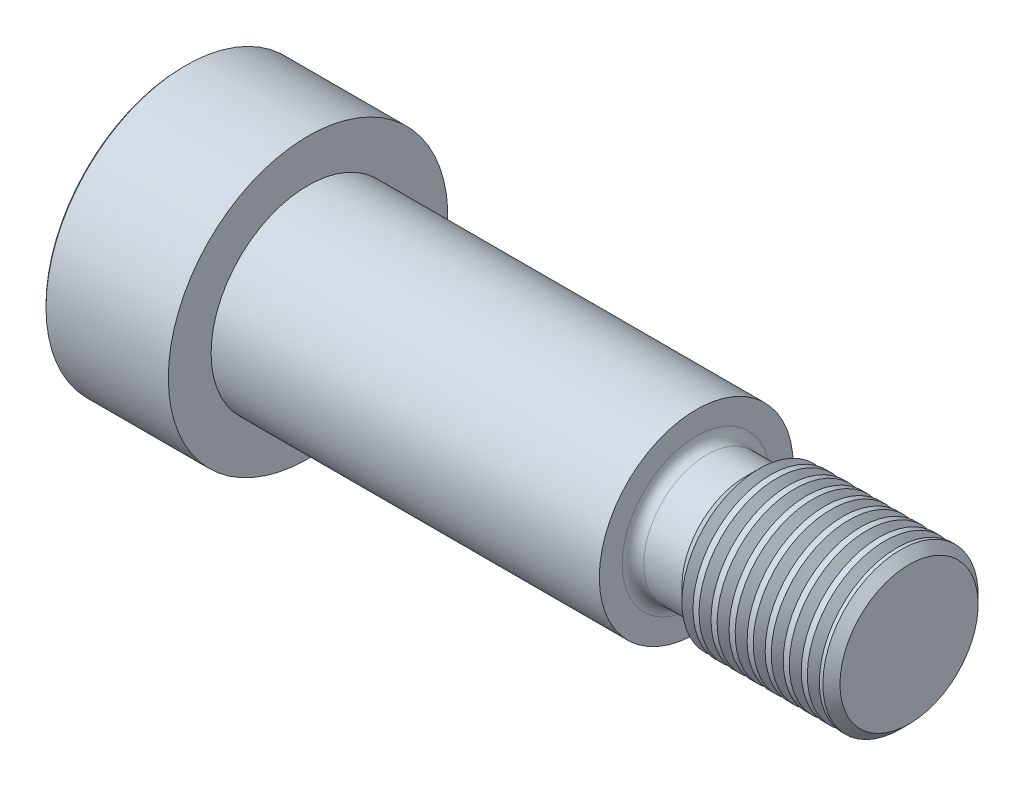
ISO-10303-21;
HEADER;
FILE_DESCRIPTION(('STEP AP214'),'2;1');
FILE_NAME('part.step','',(''),(''),'','','');
FILE_SCHEMA(('AUTOMOTIVE_DESIGN { 1 0 10303 214 1 1 1 1 }'));
ENDSEC;
DATA;
#1=APPLICATION_CONTEXT('core data for automotive mechanical design processes');
#2=APPLICATION_PROTOCOL_DEFINITION('international standard','automotive_design',2000,#1);
#3=PRODUCT_CONTEXT('',#1,'mechanical');
#4=PRODUCT('Part','Part','',(#3));
#5=PRODUCT_RELATED_PRODUCT_CATEGORY('part','',(#4));
#6=PRODUCT_DEFINITION_FORMATION('','',#4);
#7=PRODUCT_DEFINITION_CONTEXT('part definition',#1,'design');
#8=PRODUCT_DEFINITION('design','',#6,#7);
#9=PRODUCT_DEFINITION_SHAPE('','',#8);
#10=(LENGTH_UNIT() NAMED_UNIT(*) SI_UNIT(.MILLI.,.METRE.));
#11=(NAMED_UNIT(*) PLANE_ANGLE_UNIT() SI_UNIT($,.RADIAN.));
#12=(NAMED_UNIT(*) SI_UNIT($,.STERADIAN.) SOLID_ANGLE_UNIT());
#13=UNCERTAINTY_MEASURE_WITH_UNIT(LENGTH_MEASURE(1.E-05),#10,'distance_accuracy_value','');
#14=(GEOMETRIC_REPRESENTATION_CONTEXT(3) GLOBAL_UNCERTAINTY_ASSIGNED_CONTEXT((#13)) GLOBAL_UNIT_ASSIGNED_CONTEXT((#10,
#11,#12)) REPRESENTATION_CONTEXT('',''));
#15=CARTESIAN_POINT('',(0.,0.,0.));
#16=DIRECTION('',(0.,0.,1.));
#17=DIRECTION('',(1.,0.,0.));
#18=AXIS2_PLACEMENT_3D('',#15,#16,#17);
#19=CARTESIAN_POINT('',(0.,0.,0.));
#20=DIRECTION('',(-1.,0.,0.));
#21=DIRECTION('',(0.,0.,1.));
#22=AXIS2_PLACEMENT_3D('',#19,#20,#21);
#23=PLANE('',#22);
#24=CARTESIAN_POINT('',(0.,0.,0.));
#25=DIRECTION('',(-1.,0.,0.));
#26=DIRECTION('',(0.,0.,1.));
#27=AXIS2_PLACEMENT_3D('',#24,#25,#26);
#28=CIRCLE('',#27,17.75);
#29=CARTESIAN_POINT('',(0.,0.,17.75));
#30=VERTEX_POINT('',#29);
#31=EDGE_CURVE('E43',#30,#30,#28,.T.);
#32=ORIENTED_EDGE('',*,*,#31,.T.);
#33=EDGE_LOOP('',(#32));
#34=FACE_BOUND('',#33,.T.);
#35=DIRECTION('',(0.,-0.500000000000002,-0.866025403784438));
#36=VECTOR('',#35,1.);
#37=CARTESIAN_POINT('',(0.,-3.46410161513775,6.));
#38=LINE('',#37,#36);
#39=CARTESIAN_POINT('',(0.,-3.46410161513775,6.));
#40=VERTEX_POINT('',#39);
#41=CARTESIAN_POINT('',(0.,-6.92820323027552,0.));
#42=VERTEX_POINT('',#41);
#43=EDGE_CURVE('E51',#40,#42,#38,.T.);
#44=ORIENTED_EDGE('',*,*,#43,.T.);
#45=DIRECTION('',(0.,0.500000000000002,-0.866025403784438));
#46=VECTOR('',#45,1.);
#47=CARTESIAN_POINT('',(0.,-6.92820323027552,0.));
#48=LINE('',#47,#46);
#49=CARTESIAN_POINT('',(0.,-3.46410161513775,-6.));
#50=VERTEX_POINT('',#49);
#51=EDGE_CURVE('E183',#42,#50,#48,.T.);
#52=ORIENTED_EDGE('',*,*,#51,.T.);
#53=DIRECTION('',(0.,1.,0.));
#54=VECTOR('',#53,1.);
#55=CARTESIAN_POINT('',(0.,-3.46410161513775,-6.));
#56=LINE('',#55,#54);
#57=CARTESIAN_POINT('',(0.,3.46410161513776,-6.));
#58=VERTEX_POINT('',#57);
#59=EDGE_CURVE('E136',#50,#58,#56,.T.);
#60=ORIENTED_EDGE('',*,*,#59,.T.);
#61=DIRECTION('',(0.,0.5,0.866025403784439));
#62=VECTOR('',#61,1.);
#63=CARTESIAN_POINT('',(0.,3.46410161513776,-6.));
#64=LINE('',#63,#62);
#65=CARTESIAN_POINT('',(0.,6.92820323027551,0.));
#66=VERTEX_POINT('',#65);
#67=EDGE_CURVE('E266',#58,#66,#64,.T.);
#68=ORIENTED_EDGE('',*,*,#67,.T.);
#69=DIRECTION('',(0.,-0.5,0.866025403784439));
#70=VECTOR('',#69,1.);
#71=CARTESIAN_POINT('',(0.,6.92820323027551,0.));
#72=LINE('',#71,#70);
#73=CARTESIAN_POINT('',(0.,3.46410161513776,6.));
#74=VERTEX_POINT('',#73);
#75=EDGE_CURVE('E268',#66,#74,#72,.T.);
#76=ORIENTED_EDGE('',*,*,#75,.T.);
#77=DIRECTION('',(0.,-1.,0.));
#78=VECTOR('',#77,1.);
#79=CARTESIAN_POINT('',(0.,3.46410161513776,6.));
#80=LINE('',#79,#78);
#81=EDGE_CURVE('E270',#74,#40,#80,.T.);
#82=ORIENTED_EDGE('',*,*,#81,.T.);
#83=EDGE_LOOP('',(#44,#52,#60,#68,#76,#82));
#84=FACE_BOUND('',#83,.T.);
#85=ADVANCED_FACE('F34',(#34,#84),#23,.T.);
#86=CARTESIAN_POINT('',(72.3,0.,0.));
#87=DIRECTION('',(1.,0.,0.));
#88=DIRECTION('',(0.,0.,-1.));
#89=AXIS2_PLACEMENT_3D('',#86,#87,#88);
#90=CONICAL_SURFACE('',#89,8.15,0.785398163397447);
#91=CARTESIAN_POINT('',(74.0786683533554,0.,0.));
#92=DIRECTION('',(-1.,0.,0.));
#93=DIRECTION('',(0.,-1.,0.));
#94=AXIS2_PLACEMENT_3D('',#91,#92,#93);
#95=CIRCLE('',#94,9.92866835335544);
#96=CARTESIAN_POINT('',(74.0786683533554,-9.92866835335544,0.));
#97=VERTEX_POINT('',#96);
#98=EDGE_CURVE('E176',#97,#97,#95,.F.);
#99=ORIENTED_EDGE('',*,*,#98,.F.);
#100=EDGE_LOOP('',(#99));
#101=FACE_BOUND('',#100,.T.);
#102=CARTESIAN_POINT('',(72.3,0.,0.));
#103=DIRECTION('',(-1.,0.,0.));
#104=DIRECTION('',(0.,0.,1.));
#105=AXIS2_PLACEMENT_3D('',#102,#103,#104);
#106=CIRCLE('',#105,8.15);
#107=CARTESIAN_POINT('',(72.3,0.,8.15));
#108=VERTEX_POINT('',#107);
#109=EDGE_CURVE('E165',#108,#108,#106,.T.);
#110=ORIENTED_EDGE('',*,*,#109,.F.);
#111=EDGE_LOOP('',(#110));
#112=FACE_BOUND('',#111,.T.);
#113=ADVANCED_FACE('F323',(#101,#112),#90,.T.);
#114=CARTESIAN_POINT('',(-6.34999999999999,0.,0.));
#115=DIRECTION('',(-1.,0.,0.));
#116=DIRECTION('',(0.,0.,1.));
#117=AXIS2_PLACEMENT_3D('',#114,#115,#116);
#118=CYLINDRICAL_SURFACE('',#117,8.15);
#119=ORIENTED_EDGE('',*,*,#109,.T.);
#120=EDGE_LOOP('',(#119));
#121=FACE_BOUND('',#120,.T.);
#122=CARTESIAN_POINT('',(67.38,0.,0.));
#123=DIRECTION('',(-1.,0.,0.));
#124=DIRECTION('',(0.,0.,1.));
#125=AXIS2_PLACEMENT_3D('',#122,#123,#124);
#126=CIRCLE('',#125,8.15);
#127=CARTESIAN_POINT('',(67.38,0.,8.15));
#128=VERTEX_POINT('',#127);
#129=EDGE_CURVE('E162',#128,#128,#126,.T.);
#130=ORIENTED_EDGE('',*,*,#129,.F.);
#131=EDGE_LOOP('',(#130));
#132=FACE_BOUND('',#131,.T.);
#133=ADVANCED_FACE('F329',(#121,#132),#118,.T.);
#134=CARTESIAN_POINT('',(67.38,0.,0.));
#135=DIRECTION('',(-1.,0.,0.));
#136=DIRECTION('',(0.,0.,1.));
#137=AXIS2_PLACEMENT_3D('',#134,#135,#136);
#138=TOROIDAL_SURFACE('',#137,9.53,1.38);
#139=ORIENTED_EDGE('',*,*,#129,.T.);
#140=EDGE_LOOP('',(#139));
#141=FACE_BOUND('',#140,.T.);
#142=CARTESIAN_POINT('',(66.,0.,0.));
#143=DIRECTION('',(-1.,0.,0.));
#144=DIRECTION('',(0.,0.,1.));
#145=AXIS2_PLACEMENT_3D('',#142,#143,#144);
#146=CIRCLE('',#145,9.53);
#147=CARTESIAN_POINT('',(66.,0.,9.53));
#148=VERTEX_POINT('',#147);
#149=EDGE_CURVE('E159',#148,#148,#146,.T.);
#150=ORIENTED_EDGE('',*,*,#149,.F.);
#151=EDGE_LOOP('',(#150));
#152=FACE_BOUND('',#151,.T.);
#153=ADVANCED_FACE('F350',(#141,#152),#138,.F.);
#154=CARTESIAN_POINT('',(66.,12.49,0.));
#155=DIRECTION('',(1.,0.,0.));
#156=DIRECTION('',(0.,0.,-1.));
#157=AXIS2_PLACEMENT_3D('',#154,#155,#156);
#158=PLANE('',#157);
#159=ORIENTED_EDGE('',*,*,#149,.T.);
#160=EDGE_LOOP('',(#159));
#161=FACE_BOUND('',#160,.T.);
#162=CARTESIAN_POINT('',(66.,0.,0.));
#163=DIRECTION('',(-1.,0.,0.));
#164=DIRECTION('',(0.,0.,1.));
#165=AXIS2_PLACEMENT_3D('',#162,#163,#164);
#166=CIRCLE('',#165,12.49);
#167=CARTESIAN_POINT('',(66.,0.,12.49));
#168=VERTEX_POINT('',#167);
#169=EDGE_CURVE('E156',#168,#168,#166,.T.);
#170=ORIENTED_EDGE('',*,*,#169,.F.);
#171=EDGE_LOOP('',(#170));
#172=FACE_BOUND('',#171,.T.);
#173=ADVANCED_FACE('F346',(#161,#172),#158,.T.);
#174=CARTESIAN_POINT('',(-6.34999999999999,0.,0.));
#175=DIRECTION('',(-1.,0.,0.));
#176=DIRECTION('',(0.,0.,1.));
#177=AXIS2_PLACEMENT_3D('',#174,#175,#176);
#178=CYLINDRICAL_SURFACE('',#177,12.49);
#179=ORIENTED_EDGE('',*,*,#169,.T.);
#180=EDGE_LOOP('',(#179));
#181=FACE_BOUND('',#180,.T.);
#182=CARTESIAN_POINT('',(16.,0.,0.));
#183=DIRECTION('',(-1.,0.,0.));
#184=DIRECTION('',(0.,0.,1.));
#185=AXIS2_PLACEMENT_3D('',#182,#183,#184);
#186=CIRCLE('',#185,12.49);
#187=CARTESIAN_POINT('',(16.,0.,12.49));
#188=VERTEX_POINT('',#187);
#189=EDGE_CURVE('E153',#188,#188,#186,.T.);
#190=ORIENTED_EDGE('',*,*,#189,.F.);
#191=EDGE_LOOP('',(#190));
#192=FACE_BOUND('',#191,.T.);
#193=ADVANCED_FACE('F342',(#181,#192),#178,.T.);
#194=CARTESIAN_POINT('',(16.,18.,0.));
#195=DIRECTION('',(1.,0.,0.));
#196=DIRECTION('',(0.,0.,-1.));
#197=AXIS2_PLACEMENT_3D('',#194,#195,#196);
#198=PLANE('',#197);
#199=ORIENTED_EDGE('',*,*,#189,.T.);
#200=EDGE_LOOP('',(#199));
#201=FACE_BOUND('',#200,.T.);
#202=CARTESIAN_POINT('',(16.,0.,0.));
#203=DIRECTION('',(-1.,0.,0.));
#204=DIRECTION('',(0.,0.,1.));
#205=AXIS2_PLACEMENT_3D('',#202,#203,#204);
#206=CIRCLE('',#205,18.);
#207=CARTESIAN_POINT('',(16.,0.,18.));
#208=VERTEX_POINT('',#207);
#209=EDGE_CURVE('E149',#208,#208,#206,.T.);
#210=ORIENTED_EDGE('',*,*,#209,.F.);
#211=EDGE_LOOP('',(#210));
#212=FACE_BOUND('',#211,.T.);
#213=ADVANCED_FACE('F338',(#201,#212),#198,.T.);
#214=CARTESIAN_POINT('',(-6.34999999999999,0.,0.));
#215=DIRECTION('',(-1.,0.,0.));
#216=DIRECTION('',(0.,0.,1.));
#217=AXIS2_PLACEMENT_3D('',#214,#215,#216);
#218=CYLINDRICAL_SURFACE('',#217,18.);
#219=CARTESIAN_POINT('',(0.249999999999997,0.,0.));
#220=DIRECTION('',(-1.,0.,0.));
#221=DIRECTION('',(0.,0.,1.));
#222=AXIS2_PLACEMENT_3D('',#219,#220,#221);
#223=CIRCLE('',#222,18.);
#224=CARTESIAN_POINT('',(0.249999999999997,0.,18.));
#225=VERTEX_POINT('',#224);
#226=EDGE_CURVE('E11',#225,#225,#223,.F.);
#227=ORIENTED_EDGE('',*,*,#226,.T.);
#228=EDGE_LOOP('',(#227));
#229=FACE_BOUND('',#228,.T.);
#230=ORIENTED_EDGE('',*,*,#209,.T.);
#231=EDGE_LOOP('',(#230));
#232=FACE_BOUND('',#231,.T.);
#233=ADVANCED_FACE('F335',(#229,#232),#218,.T.);
#234=CARTESIAN_POINT('',(0.,0.,0.));
#235=DIRECTION('',(1.,0.,0.));
#236=DIRECTION('',(0.,0.,-1.));
#237=AXIS2_PLACEMENT_3D('',#234,#235,#236);
#238=CONICAL_SURFACE('',#237,17.75,0.785398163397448);
#239=ORIENTED_EDGE('',*,*,#226,.F.);
#240=EDGE_LOOP('',(#239));
#241=FACE_BOUND('',#240,.T.);
#242=ORIENTED_EDGE('',*,*,#31,.F.);
#243=EDGE_LOOP('',(#242));
#244=FACE_BOUND('',#243,.T.);
#245=ADVANCED_FACE('F36',(#241,#244),#238,.T.);
#246=CARTESIAN_POINT('',(10.,-6.92820323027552,0.));
#247=DIRECTION('',(0.,0.866025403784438,0.500000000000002));
#248=DIRECTION('',(0.,-0.500000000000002,0.866025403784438));
#249=AXIS2_PLACEMENT_3D('',#246,#247,#248);
#250=PLANE('',#249);
#251=DIRECTION('',(0.,0.500000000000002,-0.866025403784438));
#252=VECTOR('',#251,1.);
#253=CARTESIAN_POINT('',(10.,-6.92820323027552,0.));
#254=LINE('',#253,#252);
#255=CARTESIAN_POINT('',(10.,-6.92820323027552,0.));
#256=VERTEX_POINT('',#255);
#257=CARTESIAN_POINT('',(10.,-5.19615242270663,-3.00000000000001));
#258=VERTEX_POINT('',#257);
#259=EDGE_CURVE('E119',#256,#258,#254,.T.);
#260=ORIENTED_EDGE('',*,*,#259,.T.);
#261=CARTESIAN_POINT('',(10.,-3.46410161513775,-6.));
#262=VERTEX_POINT('',#261);
#263=EDGE_CURVE('E112',#258,#262,#254,.T.);
#264=ORIENTED_EDGE('',*,*,#263,.T.);
#265=DIRECTION('',(-1.,0.,0.));
#266=VECTOR('',#265,1.);
#267=CARTESIAN_POINT('',(10.,-3.46410161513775,-6.));
#268=LINE('',#267,#266);
#269=EDGE_CURVE('E116',#262,#50,#268,.T.);
#270=ORIENTED_EDGE('',*,*,#269,.T.);
#271=ORIENTED_EDGE('',*,*,#51,.F.);
#272=DIRECTION('',(-1.,0.,0.));
#273=VECTOR('',#272,1.);
#274=CARTESIAN_POINT('',(10.,-6.92820323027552,0.));
#275=LINE('',#274,#273);
#276=EDGE_CURVE('E263',#256,#42,#275,.T.);
#277=ORIENTED_EDGE('',*,*,#276,.F.);
#278=EDGE_LOOP('',(#260,#264,#270,#271,#277));
#279=FACE_BOUND('',#278,.T.);
#280=ADVANCED_FACE('F114',(#279),#250,.T.);
#281=CARTESIAN_POINT('',(10.,-3.46410161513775,-6.));
#282=DIRECTION('',(0.,0.,1.));
#283=DIRECTION('',(1.,0.,0.));
#284=AXIS2_PLACEMENT_3D('',#281,#282,#283);
#285=PLANE('',#284);
#286=DIRECTION('',(0.,1.,0.));
#287=VECTOR('',#286,1.);
#288=CARTESIAN_POINT('',(10.,-3.46410161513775,-6.));
#289=LINE('',#288,#287);
#290=CARTESIAN_POINT('',(10.,0.,-6.));
#291=VERTEX_POINT('',#290);
#292=EDGE_CURVE('E124',#262,#291,#289,.T.);
#293=ORIENTED_EDGE('',*,*,#292,.T.);
#294=CARTESIAN_POINT('',(10.,3.46410161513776,-6.));
#295=VERTEX_POINT('',#294);
#296=EDGE_CURVE('E131',#291,#295,#289,.T.);
#297=ORIENTED_EDGE('',*,*,#296,.T.);
#298=DIRECTION('',(-1.,0.,0.));
#299=VECTOR('',#298,1.);
#300=CARTESIAN_POINT('',(10.,3.46410161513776,-6.));
#301=LINE('',#300,#299);
#302=EDGE_CURVE('E138',#295,#58,#301,.T.);
#303=ORIENTED_EDGE('',*,*,#302,.T.);
#304=ORIENTED_EDGE('',*,*,#59,.F.);
#305=ORIENTED_EDGE('',*,*,#269,.F.);
#306=EDGE_LOOP('',(#293,#297,#303,#304,#305));
#307=FACE_BOUND('',#306,.T.);
#308=ADVANCED_FACE('F134',(#307),#285,.T.);
#309=CARTESIAN_POINT('',(10.,3.46410161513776,-6.));
#310=DIRECTION('',(0.,-0.866025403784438,0.5));
#311=DIRECTION('',(0.,-0.5,-0.866025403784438));
#312=AXIS2_PLACEMENT_3D('',#309,#310,#311);
#313=PLANE('',#312);
#314=DIRECTION('',(0.,0.5,0.866025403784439));
#315=VECTOR('',#314,1.);
#316=CARTESIAN_POINT('',(10.,3.46410161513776,-6.));
#317=LINE('',#316,#315);
#318=CARTESIAN_POINT('',(10.,5.19615242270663,-3.));
#319=VERTEX_POINT('',#318);
#320=EDGE_CURVE('E250',#295,#319,#317,.T.);
#321=ORIENTED_EDGE('',*,*,#320,.T.);
#322=CARTESIAN_POINT('',(10.,6.92820323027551,0.));
#323=VERTEX_POINT('',#322);
#324=EDGE_CURVE('E130',#319,#323,#317,.T.);
#325=ORIENTED_EDGE('',*,*,#324,.T.);
#326=DIRECTION('',(-1.,0.,0.));
#327=VECTOR('',#326,1.);
#328=CARTESIAN_POINT('',(10.,6.92820323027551,0.));
#329=LINE('',#328,#327);
#330=EDGE_CURVE('E144',#323,#66,#329,.T.);
#331=ORIENTED_EDGE('',*,*,#330,.T.);
#332=ORIENTED_EDGE('',*,*,#67,.F.);
#333=ORIENTED_EDGE('',*,*,#302,.F.);
#334=EDGE_LOOP('',(#321,#325,#331,#332,#333));
#335=FACE_BOUND('',#334,.T.);
#336=ADVANCED_FACE('F285',(#335),#313,.T.);
#337=CARTESIAN_POINT('',(10.,6.92820323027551,0.));
#338=DIRECTION('',(0.,-0.866025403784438,-0.5));
#339=DIRECTION('',(0.,0.5,-0.866025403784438));
#340=AXIS2_PLACEMENT_3D('',#337,#338,#339);
#341=PLANE('',#340);
#342=DIRECTION('',(0.,-0.5,0.866025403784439));
#343=VECTOR('',#342,1.);
#344=CARTESIAN_POINT('',(10.,6.92820323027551,0.));
#345=LINE('',#344,#343);
#346=CARTESIAN_POINT('',(10.,5.19615242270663,3.));
#347=VERTEX_POINT('',#346);
#348=EDGE_CURVE('E254',#323,#347,#345,.T.);
#349=ORIENTED_EDGE('',*,*,#348,.T.);
#350=CARTESIAN_POINT('',(10.,3.46410161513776,6.));
#351=VERTEX_POINT('',#350);
#352=EDGE_CURVE('E253',#347,#351,#345,.T.);
#353=ORIENTED_EDGE('',*,*,#352,.T.);
#354=DIRECTION('',(-1.,0.,0.));
#355=VECTOR('',#354,1.);
#356=CARTESIAN_POINT('',(10.,3.46410161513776,6.));
#357=LINE('',#356,#355);
#358=EDGE_CURVE('E278',#351,#74,#357,.T.);
#359=ORIENTED_EDGE('',*,*,#358,.T.);
#360=ORIENTED_EDGE('',*,*,#75,.F.);
#361=ORIENTED_EDGE('',*,*,#330,.F.);
#362=EDGE_LOOP('',(#349,#353,#359,#360,#361));
#363=FACE_BOUND('',#362,.T.);
#364=ADVANCED_FACE('F290',(#363),#341,.T.);
#365=CARTESIAN_POINT('',(10.,3.46410161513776,6.));
#366=DIRECTION('',(0.,0.,-1.));
#367=DIRECTION('',(-1.,0.,0.));
#368=AXIS2_PLACEMENT_3D('',#365,#366,#367);
#369=PLANE('',#368);
#370=DIRECTION('',(0.,-1.,0.));
#371=VECTOR('',#370,1.);
#372=CARTESIAN_POINT('',(10.,3.46410161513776,6.));
#373=LINE('',#372,#371);
#374=CARTESIAN_POINT('',(10.,0.,6.));
#375=VERTEX_POINT('',#374);
#376=EDGE_CURVE('E59',#351,#375,#373,.T.);
#377=ORIENTED_EDGE('',*,*,#376,.T.);
#378=CARTESIAN_POINT('',(10.,-3.46410161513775,6.));
#379=VERTEX_POINT('',#378);
#380=EDGE_CURVE('E257',#375,#379,#373,.T.);
#381=ORIENTED_EDGE('',*,*,#380,.T.);
#382=DIRECTION('',(-1.,0.,0.));
#383=VECTOR('',#382,1.);
#384=CARTESIAN_POINT('',(10.,-3.46410161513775,6.));
#385=LINE('',#384,#383);
#386=EDGE_CURVE('E275',#379,#40,#385,.T.);
#387=ORIENTED_EDGE('',*,*,#386,.T.);
#388=ORIENTED_EDGE('',*,*,#81,.F.);
#389=ORIENTED_EDGE('',*,*,#358,.F.);
#390=EDGE_LOOP('',(#377,#381,#387,#388,#389));
#391=FACE_BOUND('',#390,.T.);
#392=ADVANCED_FACE('F315',(#391),#369,.T.);
#393=CARTESIAN_POINT('',(10.,-3.46410161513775,6.));
#394=DIRECTION('',(0.,0.866025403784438,-0.500000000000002));
#395=DIRECTION('',(0.,0.500000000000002,0.866025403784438));
#396=AXIS2_PLACEMENT_3D('',#393,#394,#395);
#397=PLANE('',#396);
#398=DIRECTION('',(0.,-0.500000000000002,-0.866025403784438));
#399=VECTOR('',#398,1.);
#400=CARTESIAN_POINT('',(10.,-3.46410161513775,6.));
#401=LINE('',#400,#399);
#402=CARTESIAN_POINT('',(10.,-5.19615242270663,3.00000000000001));
#403=VERTEX_POINT('',#402);
#404=EDGE_CURVE('E260',#379,#403,#401,.T.);
#405=ORIENTED_EDGE('',*,*,#404,.T.);
#406=EDGE_CURVE('E259',#403,#256,#401,.T.);
#407=ORIENTED_EDGE('',*,*,#406,.T.);
#408=ORIENTED_EDGE('',*,*,#276,.T.);
#409=ORIENTED_EDGE('',*,*,#43,.F.);
#410=ORIENTED_EDGE('',*,*,#386,.F.);
#411=EDGE_LOOP('',(#405,#407,#408,#409,#410));
#412=FACE_BOUND('',#411,.T.);
#413=ADVANCED_FACE('F308',(#412),#397,.T.);
#414=CARTESIAN_POINT('',(10.,-6.92820323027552,0.));
#415=DIRECTION('',(-1.,0.,0.));
#416=DIRECTION('',(0.,0.,1.));
#417=AXIS2_PLACEMENT_3D('',#414,#415,#416);
#418=PLANE('',#417);
#419=ORIENTED_EDGE('',*,*,#376,.F.);
#420=ORIENTED_EDGE('',*,*,#352,.F.);
#421=CARTESIAN_POINT('',(10.,0.,0.));
#422=DIRECTION('',(-1.,0.,0.));
#423=DIRECTION('',(0.,0.,1.));
#424=AXIS2_PLACEMENT_3D('',#421,#422,#423);
#425=CIRCLE('',#424,6.);
#426=EDGE_CURVE('E143',#375,#347,#425,.T.);
#427=ORIENTED_EDGE('',*,*,#426,.F.);
#428=EDGE_LOOP('',(#419,#420,#427));
#429=FACE_BOUND('',#428,.T.);
#430=ADVANCED_FACE('F306',(#429),#418,.T.);
#431=ORIENTED_EDGE('',*,*,#348,.F.);
#432=ORIENTED_EDGE('',*,*,#324,.F.);
#433=EDGE_CURVE('E150',#347,#319,#425,.T.);
#434=ORIENTED_EDGE('',*,*,#433,.F.);
#435=EDGE_LOOP('',(#431,#432,#434));
#436=FACE_BOUND('',#435,.T.);
#437=ADVANCED_FACE('F299',(#436),#418,.T.);
#438=ORIENTED_EDGE('',*,*,#320,.F.);
#439=ORIENTED_EDGE('',*,*,#296,.F.);
#440=EDGE_CURVE('E296',#319,#291,#425,.T.);
#441=ORIENTED_EDGE('',*,*,#440,.F.);
#442=EDGE_LOOP('',(#438,#439,#441));
#443=FACE_BOUND('',#442,.T.);
#444=ADVANCED_FACE('F295',(#443),#418,.T.);
#445=ORIENTED_EDGE('',*,*,#292,.F.);
#446=ORIENTED_EDGE('',*,*,#263,.F.);
#447=EDGE_CURVE('E126',#291,#258,#425,.T.);
#448=ORIENTED_EDGE('',*,*,#447,.F.);
#449=EDGE_LOOP('',(#445,#446,#448));
#450=FACE_BOUND('',#449,.T.);
#451=ADVANCED_FACE('F125',(#450),#418,.T.);
#452=ORIENTED_EDGE('',*,*,#259,.F.);
#453=ORIENTED_EDGE('',*,*,#406,.F.);
#454=EDGE_CURVE('E141',#258,#403,#425,.T.);
#455=ORIENTED_EDGE('',*,*,#454,.F.);
#456=EDGE_LOOP('',(#452,#453,#455));
#457=FACE_BOUND('',#456,.T.);
#458=ADVANCED_FACE('F320',(#457),#418,.T.);
#459=ORIENTED_EDGE('',*,*,#404,.F.);
#460=ORIENTED_EDGE('',*,*,#380,.F.);
#461=EDGE_CURVE('E137',#403,#375,#425,.T.);
#462=ORIENTED_EDGE('',*,*,#461,.F.);
#463=EDGE_LOOP('',(#459,#460,#462));
#464=FACE_BOUND('',#463,.T.);
#465=ADVANCED_FACE('F310',(#464),#418,.T.);
#466=CARTESIAN_POINT('',(13.4641016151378,0.,0.));
#467=DIRECTION('',(-1.,0.,0.));
#468=DIRECTION('',(0.,0.,1.));
#469=AXIS2_PLACEMENT_3D('',#466,#467,#468);
#470=CONICAL_SURFACE('',#469,0.,1.04719755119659);
#471=ORIENTED_EDGE('',*,*,#426,.T.);
#472=ORIENTED_EDGE('',*,*,#433,.T.);
#473=ORIENTED_EDGE('',*,*,#440,.T.);
#474=ORIENTED_EDGE('',*,*,#447,.T.);
#475=ORIENTED_EDGE('',*,*,#454,.T.);
#476=ORIENTED_EDGE('',*,*,#461,.T.);
#477=EDGE_LOOP('',(#471,#472,#473,#474,#475,#476));
#478=FACE_BOUND('',#477,.T.);
#479=CARTESIAN_POINT('',(13.4641016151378,0.,0.));
#480=VERTEX_POINT('',#479);
#481=VERTEX_LOOP('',#480);
#482=FACE_BOUND('',#481,.T.);
#483=ADVANCED_FACE('F302',(#478,#482),#470,.F.);
#484=CARTESIAN_POINT('',(77.3147953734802,0.,0.));
#485=DIRECTION('',(1.,0.,0.));
#486=DIRECTION('',(0.,1.,0.));
#487=AXIS2_PLACEMENT_3D('',#484,#485,#486);
#488=CONICAL_SURFACE('',#487,12.49,0.959931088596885);
#489=CARTESIAN_POINT('',(75.571278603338,0.,0.));
#490=DIRECTION('',(1.,0.,0.));
#491=DIRECTION('',(0.,1.,0.));
#492=AXIS2_PLACEMENT_3D('',#489,#490,#491);
#493=CIRCLE('',#492,10.);
#494=CARTESIAN_POINT('',(75.571278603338,10.,0.));
#495=VERTEX_POINT('',#494);
#496=EDGE_CURVE('E179',#495,#495,#493,.F.);
#497=ORIENTED_EDGE('',*,*,#496,.T.);
#498=EDGE_LOOP('',(#497));
#499=FACE_BOUND('',#498,.T.);
#500=CARTESIAN_POINT('',(74.8,0.,0.));
#501=DIRECTION('',(-1.,0.,0.));
#502=DIRECTION('',(0.,-1.,0.));
#503=AXIS2_PLACEMENT_3D('',#500,#501,#502);
#504=CIRCLE('',#503,8.89850000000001);
#505=CARTESIAN_POINT('',(74.8,-8.8985,0.));
#506=VERTEX_POINT('',#505);
#507=EDGE_CURVE('E180',#506,#506,#504,.T.);
#508=ORIENTED_EDGE('',*,*,#507,.F.);
#509=EDGE_LOOP('',(#508));
#510=FACE_BOUND('',#509,.T.);
#511=ADVANCED_FACE('F485',(#499,#510),#488,.T.);
#512=CARTESIAN_POINT('',(74.8,0.,0.));
#513=DIRECTION('',(-1.,0.,0.));
#514=DIRECTION('',(0.,-1.,0.));
#515=AXIS2_PLACEMENT_3D('',#512,#513,#514);
#516=CONICAL_SURFACE('',#515,8.89850000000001,0.959931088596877);
#517=ORIENTED_EDGE('',*,*,#98,.T.);
#518=EDGE_LOOP('',(#517));
#519=FACE_BOUND('',#518,.T.);
#520=ORIENTED_EDGE('',*,*,#507,.T.);
#521=EDGE_LOOP('',(#520));
#522=FACE_BOUND('',#521,.T.);
#523=ADVANCED_FACE('F362',(#519,#522),#516,.T.);
#524=CARTESIAN_POINT('',(-6.34999999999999,0.,0.));
#525=DIRECTION('',(-1.,0.,0.));
#526=DIRECTION('',(0.,0.,1.));
#527=AXIS2_PLACEMENT_3D('',#524,#525,#526);
#528=CYLINDRICAL_SURFACE('',#527,10.);
#529=CARTESIAN_POINT('',(76.353721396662,0.,0.));
#530=DIRECTION('',(-1.,0.,0.));
#531=DIRECTION('',(0.,-1.,0.));
#532=AXIS2_PLACEMENT_3D('',#529,#530,#531);
#533=CIRCLE('',#532,10.);
#534=CARTESIAN_POINT('',(76.353721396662,-9.99999999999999,0.));
#535=VERTEX_POINT('',#534);
#536=EDGE_CURVE('E184',#535,#535,#533,.F.);
#537=ORIENTED_EDGE('',*,*,#536,.F.);
#538=EDGE_LOOP('',(#537));
#539=FACE_BOUND('',#538,.T.);
#540=ORIENTED_EDGE('',*,*,#496,.F.);
#541=EDGE_LOOP('',(#540));
#542=FACE_BOUND('',#541,.T.);
#543=ADVANCED_FACE('F358',(#539,#542),#528,.T.);
#544=CARTESIAN_POINT('',(79.6397953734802,0.,0.));
#545=DIRECTION('',(1.,0.,0.));
#546=DIRECTION('',(0.,1.,0.));
#547=AXIS2_PLACEMENT_3D('',#544,#545,#546);
#548=CONICAL_SURFACE('',#547,12.49,0.959931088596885);
#549=CARTESIAN_POINT('',(77.896278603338,0.,0.));
#550=DIRECTION('',(1.,0.,0.));
#551=DIRECTION('',(0.,1.,0.));
#552=AXIS2_PLACEMENT_3D('',#549,#550,#551);
#553=CIRCLE('',#552,10.);
#554=CARTESIAN_POINT('',(77.896278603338,10.,0.));
#555=VERTEX_POINT('',#554);
#556=EDGE_CURVE('E187',#555,#555,#553,.F.);
#557=ORIENTED_EDGE('',*,*,#556,.T.);
#558=EDGE_LOOP('',(#557));
#559=FACE_BOUND('',#558,.T.);
#560=CARTESIAN_POINT('',(77.125,0.,0.));
#561=DIRECTION('',(-1.,0.,0.));
#562=DIRECTION('',(0.,-1.,0.));
#563=AXIS2_PLACEMENT_3D('',#560,#561,#562);
#564=CIRCLE('',#563,8.89850000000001);
#565=CARTESIAN_POINT('',(77.125,-8.8985,0.));
#566=VERTEX_POINT('',#565);
#567=EDGE_CURVE('E188',#566,#566,#564,.T.);
#568=ORIENTED_EDGE('',*,*,#567,.F.);
#569=EDGE_LOOP('',(#568));
#570=FACE_BOUND('',#569,.T.);
#571=ADVANCED_FACE('F361',(#559,#570),#548,.T.);
#572=CARTESIAN_POINT('',(77.125,0.,0.));
#573=DIRECTION('',(-1.,0.,0.));
#574=DIRECTION('',(0.,-1.,0.));
#575=AXIS2_PLACEMENT_3D('',#572,#573,#574);
#576=CONICAL_SURFACE('',#575,8.89850000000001,0.959931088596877);
#577=ORIENTED_EDGE('',*,*,#536,.T.);
#578=EDGE_LOOP('',(#577));
#579=FACE_BOUND('',#578,.T.);
#580=ORIENTED_EDGE('',*,*,#567,.T.);
#581=EDGE_LOOP('',(#580));
#582=FACE_BOUND('',#581,.T.);
#583=ADVANCED_FACE('F462',(#579,#582),#576,.T.);
#584=CARTESIAN_POINT('',(78.678721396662,0.,0.));
#585=DIRECTION('',(-1.,0.,0.));
#586=DIRECTION('',(0.,-1.,0.));
#587=AXIS2_PLACEMENT_3D('',#584,#585,#586);
#588=CIRCLE('',#587,10.);
#589=CARTESIAN_POINT('',(78.678721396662,-9.99999999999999,0.));
#590=VERTEX_POINT('',#589);
#591=EDGE_CURVE('E191',#590,#590,#588,.F.);
#592=ORIENTED_EDGE('',*,*,#591,.F.);
#593=EDGE_LOOP('',(#592));
#594=FACE_BOUND('',#593,.T.);
#595=ORIENTED_EDGE('',*,*,#556,.F.);
#596=EDGE_LOOP('',(#595));
#597=FACE_BOUND('',#596,.T.);
#598=ADVANCED_FACE('F365',(#594,#597),#528,.T.);
#599=CARTESIAN_POINT('',(81.9647953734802,0.,0.));
#600=DIRECTION('',(1.,0.,0.));
#601=DIRECTION('',(0.,1.,0.));
#602=AXIS2_PLACEMENT_3D('',#599,#600,#601);
#603=CONICAL_SURFACE('',#602,12.49,0.959931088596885);
#604=CARTESIAN_POINT('',(80.221278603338,0.,0.));
#605=DIRECTION('',(1.,0.,0.));
#606=DIRECTION('',(0.,1.,0.));
#607=AXIS2_PLACEMENT_3D('',#604,#605,#606);
#608=CIRCLE('',#607,10.);
#609=CARTESIAN_POINT('',(80.221278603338,10.,0.));
#610=VERTEX_POINT('',#609);
#611=EDGE_CURVE('E194',#610,#610,#608,.F.);
#612=ORIENTED_EDGE('',*,*,#611,.T.);
#613=EDGE_LOOP('',(#612));
#614=FACE_BOUND('',#613,.T.);
#615=CARTESIAN_POINT('',(79.45,0.,0.));
#616=DIRECTION('',(-1.,0.,0.));
#617=DIRECTION('',(0.,-1.,0.));
#618=AXIS2_PLACEMENT_3D('',#615,#616,#617);
#619=CIRCLE('',#618,8.89850000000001);
#620=CARTESIAN_POINT('',(79.45,-8.8985,0.));
#621=VERTEX_POINT('',#620);
#622=EDGE_CURVE('E195',#621,#621,#619,.T.);
#623=ORIENTED_EDGE('',*,*,#622,.F.);
#624=EDGE_LOOP('',(#623));
#625=FACE_BOUND('',#624,.T.);
#626=ADVANCED_FACE('F456',(#614,#625),#603,.T.);
#627=CARTESIAN_POINT('',(79.45,0.,0.));
#628=DIRECTION('',(-1.,0.,0.));
#629=DIRECTION('',(0.,-1.,0.));
#630=AXIS2_PLACEMENT_3D('',#627,#628,#629);
#631=CONICAL_SURFACE('',#630,8.89850000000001,0.959931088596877);
#632=ORIENTED_EDGE('',*,*,#591,.T.);
#633=EDGE_LOOP('',(#632));
#634=FACE_BOUND('',#633,.T.);
#635=ORIENTED_EDGE('',*,*,#622,.T.);
#636=EDGE_LOOP('',(#635));
#637=FACE_BOUND('',#636,.T.);
#638=ADVANCED_FACE('F448',(#634,#637),#631,.T.);
#639=CARTESIAN_POINT('',(81.003721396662,0.,0.));
#640=DIRECTION('',(-1.,0.,0.));
#641=DIRECTION('',(0.,-1.,0.));
#642=AXIS2_PLACEMENT_3D('',#639,#640,#641);
#643=CIRCLE('',#642,10.);
#644=CARTESIAN_POINT('',(81.003721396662,-9.99999999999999,0.));
#645=VERTEX_POINT('',#644);
#646=EDGE_CURVE('E198',#645,#645,#643,.F.);
#647=ORIENTED_EDGE('',*,*,#646,.F.);
#648=EDGE_LOOP('',(#647));
#649=FACE_BOUND('',#648,.T.);
#650=ORIENTED_EDGE('',*,*,#611,.F.);
#651=EDGE_LOOP('',(#650));
#652=FACE_BOUND('',#651,.T.);
#653=ADVANCED_FACE('F435',(#649,#652),#528,.T.);
#654=CARTESIAN_POINT('',(84.2897953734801,0.,0.));
#655=DIRECTION('',(1.,0.,0.));
#656=DIRECTION('',(0.,1.,0.));
#657=AXIS2_PLACEMENT_3D('',#654,#655,#656);
#658=CONICAL_SURFACE('',#657,12.49,0.959931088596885);
#659=CARTESIAN_POINT('',(82.546278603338,0.,0.));
#660=DIRECTION('',(1.,0.,0.));
#661=DIRECTION('',(0.,1.,0.));
#662=AXIS2_PLACEMENT_3D('',#659,#660,#661);
#663=CIRCLE('',#662,10.);
#664=CARTESIAN_POINT('',(82.546278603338,10.,0.));
#665=VERTEX_POINT('',#664);
#666=EDGE_CURVE('E201',#665,#665,#663,.F.);
#667=ORIENTED_EDGE('',*,*,#666,.T.);
#668=EDGE_LOOP('',(#667));
#669=FACE_BOUND('',#668,.T.);
#670=CARTESIAN_POINT('',(81.775,0.,0.));
#671=DIRECTION('',(-1.,0.,0.));
#672=DIRECTION('',(0.,-1.,0.));
#673=AXIS2_PLACEMENT_3D('',#670,#671,#672);
#674=CIRCLE('',#673,8.89850000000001);
#675=CARTESIAN_POINT('',(81.775,-8.8985,0.));
#676=VERTEX_POINT('',#675);
#677=EDGE_CURVE('E202',#676,#676,#674,.T.);
#678=ORIENTED_EDGE('',*,*,#677,.F.);
#679=EDGE_LOOP('',(#678));
#680=FACE_BOUND('',#679,.T.);
#681=ADVANCED_FACE('F442',(#669,#680),#658,.T.);
#682=CARTESIAN_POINT('',(81.775,0.,0.));
#683=DIRECTION('',(-1.,0.,0.));
#684=DIRECTION('',(0.,-1.,0.));
#685=AXIS2_PLACEMENT_3D('',#682,#683,#684);
#686=CONICAL_SURFACE('',#685,8.89850000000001,0.959931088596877);
#687=ORIENTED_EDGE('',*,*,#646,.T.);
#688=EDGE_LOOP('',(#687));
#689=FACE_BOUND('',#688,.T.);
#690=ORIENTED_EDGE('',*,*,#677,.T.);
#691=EDGE_LOOP('',(#690));
#692=FACE_BOUND('',#691,.T.);
#693=ADVANCED_FACE('F433',(#689,#692),#686,.T.);
#694=CARTESIAN_POINT('',(83.328721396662,0.,0.));
#695=DIRECTION('',(-1.,0.,0.));
#696=DIRECTION('',(0.,-1.,0.));
#697=AXIS2_PLACEMENT_3D('',#694,#695,#696);
#698=CIRCLE('',#697,10.);
#699=CARTESIAN_POINT('',(83.328721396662,-9.99999999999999,0.));
#700=VERTEX_POINT('',#699);
#701=EDGE_CURVE('E205',#700,#700,#698,.F.);
#702=ORIENTED_EDGE('',*,*,#701,.F.);
#703=EDGE_LOOP('',(#702));
#704=FACE_BOUND('',#703,.T.);
#705=ORIENTED_EDGE('',*,*,#666,.F.);
#706=EDGE_LOOP('',(#705));
#707=FACE_BOUND('',#706,.T.);
#708=ADVANCED_FACE('F420',(#704,#707),#528,.T.);
#709=CARTESIAN_POINT('',(86.6147953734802,0.,0.));
#710=DIRECTION('',(1.,0.,0.));
#711=DIRECTION('',(0.,1.,0.));
#712=AXIS2_PLACEMENT_3D('',#709,#710,#711);
#713=CONICAL_SURFACE('',#712,12.49,0.959931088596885);
#714=CARTESIAN_POINT('',(84.871278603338,0.,0.));
#715=DIRECTION('',(1.,0.,0.));
#716=DIRECTION('',(0.,1.,0.));
#717=AXIS2_PLACEMENT_3D('',#714,#715,#716);
#718=CIRCLE('',#717,10.);
#719=CARTESIAN_POINT('',(84.871278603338,10.,0.));
#720=VERTEX_POINT('',#719);
#721=EDGE_CURVE('E208',#720,#720,#718,.F.);
#722=ORIENTED_EDGE('',*,*,#721,.T.);
#723=EDGE_LOOP('',(#722));
#724=FACE_BOUND('',#723,.T.);
#725=CARTESIAN_POINT('',(84.1,0.,0.));
#726=DIRECTION('',(-1.,0.,0.));
#727=DIRECTION('',(0.,-1.,0.));
#728=AXIS2_PLACEMENT_3D('',#725,#726,#727);
#729=CIRCLE('',#728,8.89850000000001);
#730=CARTESIAN_POINT('',(84.1,-8.8985,0.));
#731=VERTEX_POINT('',#730);
#732=EDGE_CURVE('E209',#731,#731,#729,.T.);
#733=ORIENTED_EDGE('',*,*,#732,.F.);
#734=EDGE_LOOP('',(#733));
#735=FACE_BOUND('',#734,.T.);
#736=ADVANCED_FACE('F427',(#724,#735),#713,.T.);
#737=CARTESIAN_POINT('',(84.1,0.,0.));
#738=DIRECTION('',(-1.,0.,0.));
#739=DIRECTION('',(0.,-1.,0.));
#740=AXIS2_PLACEMENT_3D('',#737,#738,#739);
#741=CONICAL_SURFACE('',#740,8.89850000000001,0.959931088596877);
#742=ORIENTED_EDGE('',*,*,#701,.T.);
#743=EDGE_LOOP('',(#742));
#744=FACE_BOUND('',#743,.T.);
#745=ORIENTED_EDGE('',*,*,#732,.T.);
#746=EDGE_LOOP('',(#745));
#747=FACE_BOUND('',#746,.T.);
#748=ADVANCED_FACE('F418',(#744,#747),#741,.T.);
#749=CARTESIAN_POINT('',(85.653721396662,0.,0.));
#750=DIRECTION('',(-1.,0.,0.));
#751=DIRECTION('',(0.,-1.,0.));
#752=AXIS2_PLACEMENT_3D('',#749,#750,#751);
#753=CIRCLE('',#752,10.);
#754=CARTESIAN_POINT('',(85.653721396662,-9.99999999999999,0.));
#755=VERTEX_POINT('',#754);
#756=EDGE_CURVE('E212',#755,#755,#753,.F.);
#757=ORIENTED_EDGE('',*,*,#756,.F.);
#758=EDGE_LOOP('',(#757));
#759=FACE_BOUND('',#758,.T.);
#760=ORIENTED_EDGE('',*,*,#721,.F.);
#761=EDGE_LOOP('',(#760));
#762=FACE_BOUND('',#761,.T.);
#763=ADVANCED_FACE('F405',(#759,#762),#528,.T.);
#764=CARTESIAN_POINT('',(88.9397953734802,0.,0.));
#765=DIRECTION('',(1.,0.,0.));
#766=DIRECTION('',(0.,1.,0.));
#767=AXIS2_PLACEMENT_3D('',#764,#765,#766);
#768=CONICAL_SURFACE('',#767,12.49,0.959931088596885);
#769=CARTESIAN_POINT('',(87.196278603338,0.,0.));
#770=DIRECTION('',(1.,0.,0.));
#771=DIRECTION('',(0.,1.,0.));
#772=AXIS2_PLACEMENT_3D('',#769,#770,#771);
#773=CIRCLE('',#772,10.);
#774=CARTESIAN_POINT('',(87.196278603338,10.,0.));
#775=VERTEX_POINT('',#774);
#776=EDGE_CURVE('E215',#775,#775,#773,.F.);
#777=ORIENTED_EDGE('',*,*,#776,.T.);
#778=EDGE_LOOP('',(#777));
#779=FACE_BOUND('',#778,.T.);
#780=CARTESIAN_POINT('',(86.425,0.,0.));
#781=DIRECTION('',(-1.,0.,0.));
#782=DIRECTION('',(0.,-1.,0.));
#783=AXIS2_PLACEMENT_3D('',#780,#781,#782);
#784=CIRCLE('',#783,8.89850000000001);
#785=CARTESIAN_POINT('',(86.425,-8.8985,0.));
#786=VERTEX_POINT('',#785);
#787=EDGE_CURVE('E216',#786,#786,#784,.T.);
#788=ORIENTED_EDGE('',*,*,#787,.F.);
#789=EDGE_LOOP('',(#788));
#790=FACE_BOUND('',#789,.T.);
#791=ADVANCED_FACE('F412',(#779,#790),#768,.T.);
#792=CARTESIAN_POINT('',(86.425,0.,0.));
#793=DIRECTION('',(-1.,0.,0.));
#794=DIRECTION('',(0.,-1.,0.));
#795=AXIS2_PLACEMENT_3D('',#792,#793,#794);
#796=CONICAL_SURFACE('',#795,8.89850000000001,0.959931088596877);
#797=ORIENTED_EDGE('',*,*,#756,.T.);
#798=EDGE_LOOP('',(#797));
#799=FACE_BOUND('',#798,.T.);
#800=ORIENTED_EDGE('',*,*,#787,.T.);
#801=EDGE_LOOP('',(#800));
#802=FACE_BOUND('',#801,.T.);
#803=ADVANCED_FACE('F403',(#799,#802),#796,.T.);
#804=CARTESIAN_POINT('',(87.978721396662,0.,0.));
#805=DIRECTION('',(-1.,0.,0.));
#806=DIRECTION('',(0.,-1.,0.));
#807=AXIS2_PLACEMENT_3D('',#804,#805,#806);
#808=CIRCLE('',#807,10.);
#809=CARTESIAN_POINT('',(87.978721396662,-9.99999999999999,0.));
#810=VERTEX_POINT('',#809);
#811=EDGE_CURVE('E219',#810,#810,#808,.F.);
#812=ORIENTED_EDGE('',*,*,#811,.F.);
#813=EDGE_LOOP('',(#812));
#814=FACE_BOUND('',#813,.T.);
#815=ORIENTED_EDGE('',*,*,#776,.F.);
#816=EDGE_LOOP('',(#815));
#817=FACE_BOUND('',#816,.T.);
#818=ADVANCED_FACE('F391',(#814,#817),#528,.T.);
#819=CARTESIAN_POINT('',(91.2647953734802,0.,0.));
#820=DIRECTION('',(1.,0.,0.));
#821=DIRECTION('',(0.,1.,0.));
#822=AXIS2_PLACEMENT_3D('',#819,#820,#821);
#823=CONICAL_SURFACE('',#822,12.49,0.959931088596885);
#824=CARTESIAN_POINT('',(89.521278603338,0.,0.));
#825=DIRECTION('',(1.,0.,0.));
#826=DIRECTION('',(0.,1.,0.));
#827=AXIS2_PLACEMENT_3D('',#824,#825,#826);
#828=CIRCLE('',#827,10.);
#829=CARTESIAN_POINT('',(89.521278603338,10.,0.));
#830=VERTEX_POINT('',#829);
#831=EDGE_CURVE('E222',#830,#830,#828,.F.);
#832=ORIENTED_EDGE('',*,*,#831,.T.);
#833=EDGE_LOOP('',(#832));
#834=FACE_BOUND('',#833,.T.);
#835=CARTESIAN_POINT('',(88.75,0.,0.));
#836=DIRECTION('',(-1.,0.,0.));
#837=DIRECTION('',(0.,-1.,0.));
#838=AXIS2_PLACEMENT_3D('',#835,#836,#837);
#839=CIRCLE('',#838,8.89850000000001);
#840=CARTESIAN_POINT('',(88.75,-8.8985,0.));
#841=VERTEX_POINT('',#840);
#842=EDGE_CURVE('E223',#841,#841,#839,.T.);
#843=ORIENTED_EDGE('',*,*,#842,.F.);
#844=EDGE_LOOP('',(#843));
#845=FACE_BOUND('',#844,.T.);
#846=ADVANCED_FACE('F398',(#834,#845),#823,.T.);
#847=CARTESIAN_POINT('',(88.75,0.,0.));
#848=DIRECTION('',(-1.,0.,0.));
#849=DIRECTION('',(0.,-1.,0.));
#850=AXIS2_PLACEMENT_3D('',#847,#848,#849);
#851=CONICAL_SURFACE('',#850,8.89850000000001,0.959931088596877);
#852=ORIENTED_EDGE('',*,*,#811,.T.);
#853=EDGE_LOOP('',(#852));
#854=FACE_BOUND('',#853,.T.);
#855=ORIENTED_EDGE('',*,*,#842,.T.);
#856=EDGE_LOOP('',(#855));
#857=FACE_BOUND('',#856,.T.);
#858=ADVANCED_FACE('F389',(#854,#857),#851,.T.);
#859=CARTESIAN_POINT('',(90.303721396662,0.,0.));
#860=DIRECTION('',(-1.,0.,0.));
#861=DIRECTION('',(0.,-1.,0.));
#862=AXIS2_PLACEMENT_3D('',#859,#860,#861);
#863=CIRCLE('',#862,10.);
#864=CARTESIAN_POINT('',(90.303721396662,-9.99999999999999,0.));
#865=VERTEX_POINT('',#864);
#866=EDGE_CURVE('E225',#865,#865,#863,.F.);
#867=ORIENTED_EDGE('',*,*,#866,.F.);
#868=EDGE_LOOP('',(#867));
#869=FACE_BOUND('',#868,.T.);
#870=ORIENTED_EDGE('',*,*,#831,.F.);
#871=EDGE_LOOP('',(#870));
#872=FACE_BOUND('',#871,.T.);
#873=ADVANCED_FACE('F384',(#869,#872),#528,.T.);
#874=CARTESIAN_POINT('',(93.5897953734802,0.,0.));
#875=DIRECTION('',(1.,0.,0.));
#876=DIRECTION('',(0.,1.,0.));
#877=AXIS2_PLACEMENT_3D('',#874,#875,#876);
#878=CONICAL_SURFACE('',#877,12.49,0.959931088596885);
#879=CARTESIAN_POINT('',(91.846278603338,0.,0.));
#880=DIRECTION('',(1.,0.,0.));
#881=DIRECTION('',(0.,1.,0.));
#882=AXIS2_PLACEMENT_3D('',#879,#880,#881);
#883=CIRCLE('',#882,10.);
#884=CARTESIAN_POINT('',(91.846278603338,10.,0.));
#885=VERTEX_POINT('',#884);
#886=EDGE_CURVE('E38',#885,#885,#883,.F.);
#887=ORIENTED_EDGE('',*,*,#886,.T.);
#888=EDGE_LOOP('',(#887));
#889=FACE_BOUND('',#888,.T.);
#890=CARTESIAN_POINT('',(91.075,0.,0.));
#891=DIRECTION('',(-1.,0.,0.));
#892=DIRECTION('',(0.,-1.,0.));
#893=AXIS2_PLACEMENT_3D('',#890,#891,#892);
#894=CIRCLE('',#893,8.89850000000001);
#895=CARTESIAN_POINT('',(91.075,-8.8985,0.));
#896=VERTEX_POINT('',#895);
#897=EDGE_CURVE('E227',#896,#896,#894,.T.);
#898=ORIENTED_EDGE('',*,*,#897,.F.);
#899=EDGE_LOOP('',(#898));
#900=FACE_BOUND('',#899,.T.);
#901=ADVANCED_FACE('F376',(#889,#900),#878,.T.);
#902=CARTESIAN_POINT('',(91.075,0.,0.));
#903=DIRECTION('',(-1.,0.,0.));
#904=DIRECTION('',(0.,-1.,0.));
#905=AXIS2_PLACEMENT_3D('',#902,#903,#904);
#906=CONICAL_SURFACE('',#905,8.89850000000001,0.959931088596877);
#907=ORIENTED_EDGE('',*,*,#866,.T.);
#908=EDGE_LOOP('',(#907));
#909=FACE_BOUND('',#908,.T.);
#910=ORIENTED_EDGE('',*,*,#897,.T.);
#911=EDGE_LOOP('',(#910));
#912=FACE_BOUND('',#911,.T.);
#913=ADVANCED_FACE('F371',(#909,#912),#906,.T.);
#914=CARTESIAN_POINT('',(93.4,8.8985,0.));
#915=DIRECTION('',(1.,0.,0.));
#916=DIRECTION('',(0.,0.,-1.));
#917=AXIS2_PLACEMENT_3D('',#914,#915,#916);
#918=PLANE('',#917);
#919=CARTESIAN_POINT('',(93.4,0.,0.));
#920=DIRECTION('',(-1.,0.,0.));
#921=DIRECTION('',(0.,0.,1.));
#922=AXIS2_PLACEMENT_3D('',#919,#920,#921);
#923=CIRCLE('',#922,8.8985);
#924=CARTESIAN_POINT('',(93.4,0.,8.8985));
#925=VERTEX_POINT('',#924);
#926=EDGE_CURVE('E171',#925,#925,#923,.T.);
#927=ORIENTED_EDGE('',*,*,#926,.F.);
#928=EDGE_LOOP('',(#927));
#929=FACE_BOUND('',#928,.T.);
#930=ADVANCED_FACE('F368',(#929),#918,.T.);
#931=CARTESIAN_POINT('',(92.2985,0.,0.));
#932=DIRECTION('',(-1.,0.,0.));
#933=DIRECTION('',(0.,0.,1.));
#934=AXIS2_PLACEMENT_3D('',#931,#932,#933);
#935=CONICAL_SURFACE('',#934,10.,0.785398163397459);
#936=ORIENTED_EDGE('',*,*,#926,.T.);
#937=EDGE_LOOP('',(#936));
#938=FACE_BOUND('',#937,.T.);
#939=CARTESIAN_POINT('',(92.2985,0.,0.));
#940=DIRECTION('',(-1.,0.,0.));
#941=DIRECTION('',(0.,0.,1.));
#942=AXIS2_PLACEMENT_3D('',#939,#940,#941);
#943=CIRCLE('',#942,10.);
#944=CARTESIAN_POINT('',(92.2985,0.,10.));
#945=VERTEX_POINT('',#944);
#946=EDGE_CURVE('E168',#945,#945,#943,.T.);
#947=ORIENTED_EDGE('',*,*,#946,.F.);
#948=EDGE_LOOP('',(#947));
#949=FACE_BOUND('',#948,.T.);
#950=ADVANCED_FACE('F366',(#938,#949),#935,.T.);
#951=ORIENTED_EDGE('',*,*,#886,.F.);
#952=EDGE_LOOP('',(#951));
#953=FACE_BOUND('',#952,.T.);
#954=ORIENTED_EDGE('',*,*,#946,.T.);
#955=EDGE_LOOP('',(#954));
#956=FACE_BOUND('',#955,.T.);
#957=ADVANCED_FACE('F364',(#953,#956),#528,.T.);
#958=CLOSED_SHELL('',(#85,#113,#133,#153,#173,#193,#213,#233,#245,#280,#308,#336,#364,#392,#413,
#430,#437,#444,#451,#458,#465,#483,#511,#523,#543,#571,#583,#598,#626,#638,#653,#681,#693,#708,
#736,#748,#763,#791,#803,#818,#846,#858,#873,#901,#913,#930,#950,#957));
#959=MANIFOLD_SOLID_BREP('B2',#958);
#960=ADVANCED_BREP_SHAPE_REPRESENTATION('',(#18,#959),#14);
#961=SHAPE_DEFINITION_REPRESENTATION(#9,#960);
ENDSEC;
END-ISO-10303-21;
